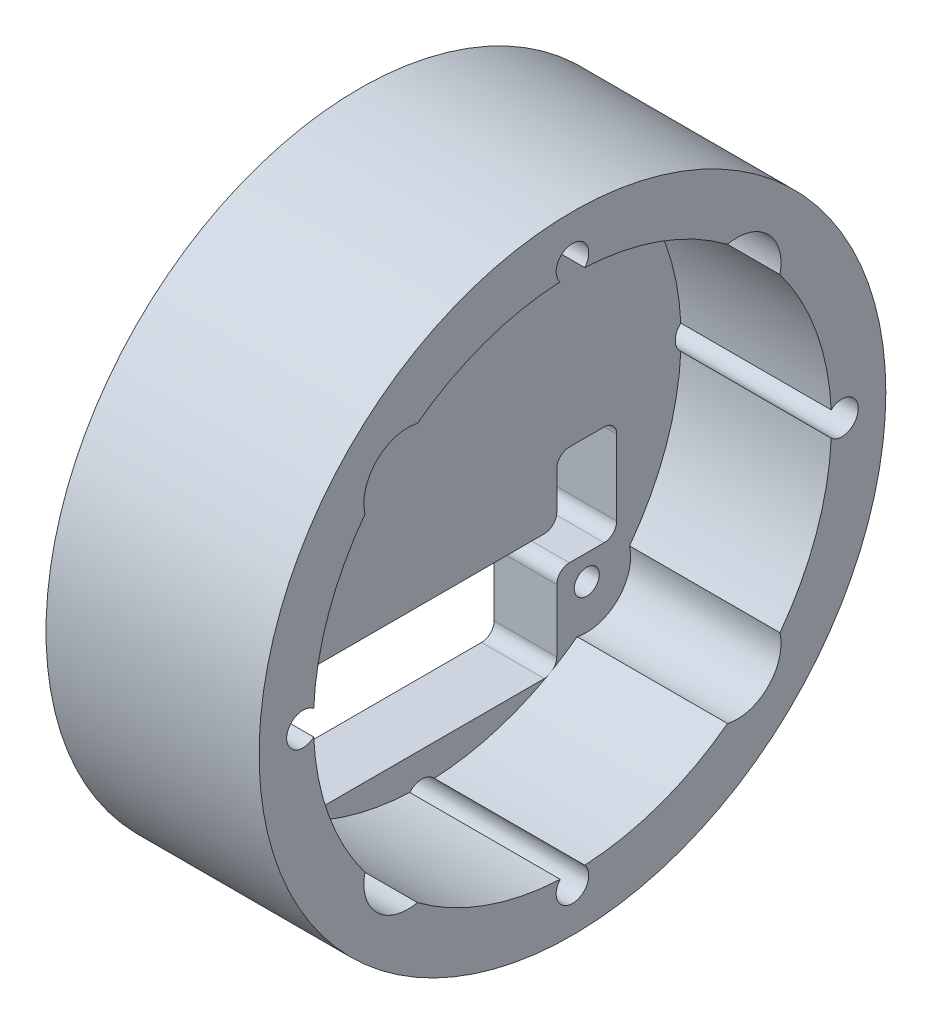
from build123d import *

# Parameters (mm, degrees)
SKETCH1_R               = 25
BOSS_EXTRUDE1_DEPTH     = 5
SKETCH3_R               = 1
CUT_EXTRUDE2_DEPTH      = 36.707142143
SKETCH4_R               = 25
SKETCH4_R_2             = 20.666666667
BOSS_EXTRUDE2_DEPTH     = 12
CUT_EXTRUDE1_DEPTH      = 38.336309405
CUT_EXTRUDE1_DEPTH_BACK = 38.336309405
SKETCH2_R               = 1.3
CUT_EXTRUDE3_DEPTH      = 38.336309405
CUT_EXTRUDE5_DEPTH      = 38.336309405


with BuildPart() as part:
    # Sketch1 → Boss-Extrude1 (new body)
    with BuildSketch(Plane(origin=(0, 0, 0), x_dir=(0, 0, -1), z_dir=(1, 0, 0))):
        Circle(SKETCH1_R)
    extrude(amount=BOSS_EXTRUDE1_DEPTH)

    # Sketch3 → Cut-Extrude2 (cut, through all)
    with BuildSketch(Plane.ZY):
        with Locations((-13.14, 13.14)):
            Circle(SKETCH3_R)
        with Locations((13.14, 13.14)):
            Circle(SKETCH3_R)
        with Locations((13.14, -13.14)):
            Circle(SKETCH3_R)
        with Locations((-13.14, -13.14)):
            Circle(SKETCH3_R)
    extrude(amount=-CUT_EXTRUDE2_DEPTH, mode=Mode.SUBTRACT)

    # Sketch4 → Boss-Extrude2 (add)
    with BuildSketch(Plane(origin=(5, 0, 0), x_dir=(0, 0, -1), z_dir=(1, 0, 0))):
        Circle(SKETCH4_R)
        Circle(SKETCH4_R_2, mode=Mode.SUBTRACT)
    extrude(amount=BOSS_EXTRUDE2_DEPTH)

    # Sketch2 → Cut-Extrude1 (cut, two sides: drawn at the far end of the back side and taken through both)
    with BuildSketch(Plane(origin=(5, 0, 0), x_dir=(0, 0, -1), z_dir=(1, 0, 0)).offset(-CUT_EXTRUDE1_DEPTH_BACK)):
        with Locations((0, 21.5)):
            Circle(SKETCH2_R)
        with Locations((21.5, 0)):
            Circle(SKETCH2_R)
        with Locations((0, -21.5)):
            Circle(SKETCH2_R)
        with Locations((-21.5, 0)):
            Circle(SKETCH2_R)
    extrude(amount=CUT_EXTRUDE1_DEPTH + CUT_EXTRUDE1_DEPTH_BACK, mode=Mode.SUBTRACT)

    # Sketch5 → Cut-Extrude3 (cut, through all)
    with BuildSketch(Plane(origin=(5, 0, 0), x_dir=(0, 0, -1), z_dir=(1, 0, 0))):
        with BuildLine():
            Line((9.75, -8.14), (-9.75, -8.14))
            ThreePointArc((-9.75, -8.14), (-10.457106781, -8.432893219), (-10.75, -9.14))
            Line((-10.75, -9.14), (-10.75, -17.14))
            ThreePointArc((-10.75, -17.14), (-10.457106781, -17.847106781), (-9.75, -18.14))
            Line((-9.75, -18.14), (9.75, -18.14))
            ThreePointArc((9.75, -18.14), (10.457106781, -17.847106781), (10.75, -17.14))
            Line((10.75, -17.14), (10.75, -12.14))
            ThreePointArc((10.75, -12.14), (11.042893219, -11.432893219), (11.75, -11.14))
            Line((11.75, -11.14), (14.53, -11.14))
            ThreePointArc((14.53, -11.14), (15.237106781, -10.847106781), (15.53, -10.14))
            Line((15.53, -10.14), (15.53, -4.14))
            ThreePointArc((15.53, -4.14), (15.237106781, -3.432893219), (14.53, -3.14))
            Line((14.53, -3.14), (11.75, -3.14))
            ThreePointArc((11.75, -3.14), (11.042893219, -3.432893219), (10.75, -4.14))
            Line((10.75, -4.14), (10.75, -7.14))
            ThreePointArc((10.75, -7.14), (10.457106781, -7.847106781), (9.75, -8.14))
        make_face()
    extrude(amount=-CUT_EXTRUDE3_DEPTH, mode=Mode.SUBTRACT)

    # Sketch7 → Cut-Extrude5 (cut, through all)
    with BuildSketch(Plane(origin=(5, 0, 0), x_dir=(0, 0, -1), z_dir=(1, 0, 0))):
        with BuildLine():
            Line((-10.665126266, 15.614873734), (0, 4.949747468))
            Line((0, 4.949747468), (10.665126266, 15.614873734))
            ThreePointArc((10.665126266, 15.614873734), (15.614873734, 15.614873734), (15.614873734, 10.665126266))
            Line((15.614873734, 10.665126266), (4.949747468, 0))
            Line((4.949747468, 0), (15.614873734, -10.665126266))
            ThreePointArc((15.614873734, -10.665126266), (15.614873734, -15.614873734), (10.665126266, -15.614873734))
            Line((10.665126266, -15.614873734), (0, -4.949747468))
            Line((0, -4.949747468), (-10.665126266, -15.614873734))
            ThreePointArc((-10.665126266, -15.614873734), (-15.614873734, -15.614873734), (-15.614873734, -10.665126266))
            Line((-15.614873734, -10.665126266), (-4.949747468, 0))
            Line((-4.949747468, 0), (-15.614873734, 10.665126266))
            ThreePointArc((-15.614873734, 10.665126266), (-15.614873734, 15.614873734), (-10.665126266, 15.614873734))
        make_face()
    extrude(amount=CUT_EXTRUDE5_DEPTH, mode=Mode.SUBTRACT)


solid = part.part
